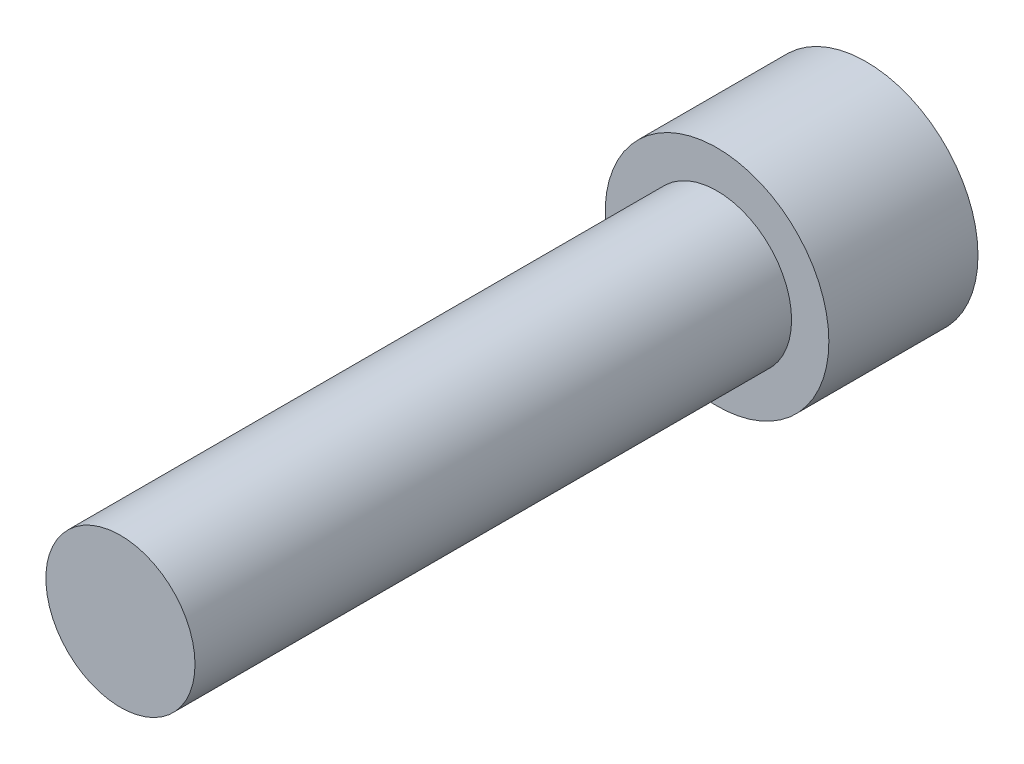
from build123d import *

# Parameters (mm, degrees)
HEX_2_DEPTH = 3.556


with BuildPart() as part:
    # Sketch6 → Revolve1 (revolve)
    with BuildSketch(Plane(origin=(0, 0, 0), x_dir=(0, 0, -1), z_dir=(1, 0, 0)), mode=Mode.PRIVATE) as revolve1_sk:
        Polygon((-25.4, 0), (-25.4, -3.175), (0, -3.175), (0, -4.7625), (6.35, -4.7625), (6.35, 0), align=None)
    revolve(revolve1_sk.sketch.rotate(Axis((0, 0, 25.4), (0, 0, -1)), 270), axis=Axis((0, 0, 25.4), (0, 0, -1)))

    # Sketch7 → HEX 2 (cut)
    with BuildSketch(Plane(origin=(0, 0, -6.35), x_dir=(-1, 0, 0), z_dir=(0, 0, -1))):
        Polygon((-2.3876, 1.378481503), (-2.3876, -1.378481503), (0, -2.756963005), (2.3876, -1.378481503), (2.3876, 1.378481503), (0, 2.756963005), align=None)
    extrude(amount=-HEX_2_DEPTH, mode=Mode.SUBTRACT)


solid = part.part
